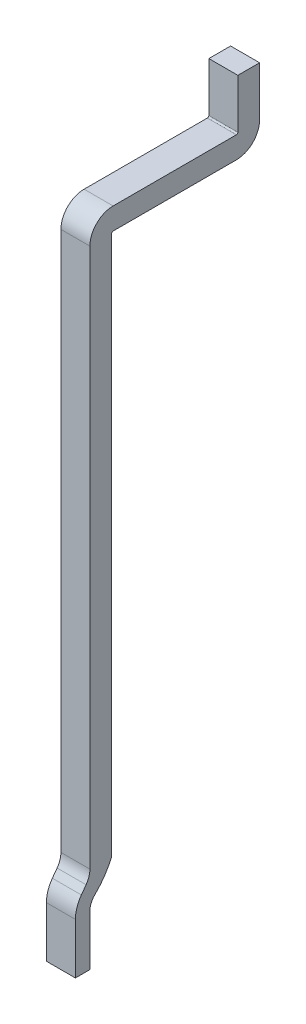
ISO-10303-21;
HEADER;
FILE_DESCRIPTION(('STEP AP214'),'2;1');
FILE_NAME('part.step','',(''),(''),'','','');
FILE_SCHEMA(('AUTOMOTIVE_DESIGN { 1 0 10303 214 1 1 1 1 }'));
ENDSEC;
DATA;
#1=APPLICATION_CONTEXT('core data for automotive mechanical design processes');
#2=APPLICATION_PROTOCOL_DEFINITION('international standard','automotive_design',2000,#1);
#3=PRODUCT_CONTEXT('',#1,'mechanical');
#4=PRODUCT('Part','Part','',(#3));
#5=PRODUCT_RELATED_PRODUCT_CATEGORY('part','',(#4));
#6=PRODUCT_DEFINITION_FORMATION('','',#4);
#7=PRODUCT_DEFINITION_CONTEXT('part definition',#1,'design');
#8=PRODUCT_DEFINITION('design','',#6,#7);
#9=PRODUCT_DEFINITION_SHAPE('','',#8);
#10=(LENGTH_UNIT() NAMED_UNIT(*) SI_UNIT(.MILLI.,.METRE.));
#11=(NAMED_UNIT(*) PLANE_ANGLE_UNIT() SI_UNIT($,.RADIAN.));
#12=(NAMED_UNIT(*) SI_UNIT($,.STERADIAN.) SOLID_ANGLE_UNIT());
#13=UNCERTAINTY_MEASURE_WITH_UNIT(LENGTH_MEASURE(1.E-05),#10,'distance_accuracy_value','');
#14=(GEOMETRIC_REPRESENTATION_CONTEXT(3) GLOBAL_UNCERTAINTY_ASSIGNED_CONTEXT((#13)) GLOBAL_UNIT_ASSIGNED_CONTEXT((#10,
#11,#12)) REPRESENTATION_CONTEXT('',''));
#15=CARTESIAN_POINT('',(0.,0.,0.));
#16=DIRECTION('',(0.,0.,1.));
#17=DIRECTION('',(1.,0.,0.));
#18=AXIS2_PLACEMENT_3D('',#15,#16,#17);
#19=CARTESIAN_POINT('',(-4.898179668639,-0.6,0.15));
#20=DIRECTION('',(0.,0.,1.));
#21=DIRECTION('',(1.,0.,0.));
#22=AXIS2_PLACEMENT_3D('',#19,#20,#21);
#23=PLANE('',#22);
#24=DIRECTION('',(1.,0.,0.));
#25=VECTOR('',#24,1.);
#26=CARTESIAN_POINT('',(-4.898179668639,-0.25,0.15));
#27=LINE('',#26,#25);
#28=CARTESIAN_POINT('',(-0.1,-0.25,0.15));
#29=VERTEX_POINT('',#28);
#30=CARTESIAN_POINT('',(0.1,-0.25,0.15));
#31=VERTEX_POINT('',#30);
#32=EDGE_CURVE('E11',#29,#31,#27,.T.);
#33=ORIENTED_EDGE('',*,*,#32,.T.);
#34=DIRECTION('',(0.,-1.,0.));
#35=VECTOR('',#34,1.);
#36=CARTESIAN_POINT('',(0.1,-0.6,0.15));
#37=LINE('',#36,#35);
#38=CARTESIAN_POINT('',(0.1,-0.6,0.15));
#39=VERTEX_POINT('',#38);
#40=EDGE_CURVE('E242',#31,#39,#37,.T.);
#41=ORIENTED_EDGE('',*,*,#40,.T.);
#42=DIRECTION('',(1.,0.,0.));
#43=VECTOR('',#42,1.);
#44=CARTESIAN_POINT('',(-4.898179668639,-0.6,0.15));
#45=LINE('',#44,#43);
#46=CARTESIAN_POINT('',(-0.1,-0.6,0.15));
#47=VERTEX_POINT('',#46);
#48=EDGE_CURVE('E37',#47,#39,#45,.T.);
#49=ORIENTED_EDGE('',*,*,#48,.F.);
#50=DIRECTION('',(0.,-1.,0.));
#51=VECTOR('',#50,1.);
#52=CARTESIAN_POINT('',(-0.1,3.88,0.15));
#53=LINE('',#52,#51);
#54=EDGE_CURVE('E374',#29,#47,#53,.T.);
#55=ORIENTED_EDGE('',*,*,#54,.F.);
#56=EDGE_LOOP('',(#33,#41,#49,#55));
#57=FACE_BOUND('',#56,.T.);
#58=ADVANCED_FACE('F17',(#57),#23,.F.);
#59=CARTESIAN_POINT('',(-4.898179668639,-0.25,0.03819360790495));
#60=DIRECTION('',(1.,0.,0.));
#61=DIRECTION('',(0.,1.,0.));
#62=AXIS2_PLACEMENT_3D('',#59,#60,#61);
#63=CYLINDRICAL_SURFACE('',#62,0.111806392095);
#64=DIRECTION('',(1.,0.,0.));
#65=VECTOR('',#64,1.);
#66=CARTESIAN_POINT('',(-4.898179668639,-0.169431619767,0.11571396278));
#67=LINE('',#66,#65);
#68=CARTESIAN_POINT('',(-0.1,-0.169431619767,0.11571396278));
#69=VERTEX_POINT('',#68);
#70=CARTESIAN_POINT('',(0.1,-0.169431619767,0.11571396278));
#71=VERTEX_POINT('',#70);
#72=EDGE_CURVE('E25',#69,#71,#67,.T.);
#73=ORIENTED_EDGE('',*,*,#72,.T.);
#74=CARTESIAN_POINT('',(0.1,-0.25,0.03819360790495));
#75=DIRECTION('',(1.,0.,0.));
#76=DIRECTION('',(0.,1.,0.));
#77=AXIS2_PLACEMENT_3D('',#74,#75,#76);
#78=CIRCLE('',#77,0.111806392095);
#79=EDGE_CURVE('E262',#71,#31,#78,.T.);
#80=ORIENTED_EDGE('',*,*,#79,.T.);
#81=ORIENTED_EDGE('',*,*,#32,.F.);
#82=CARTESIAN_POINT('',(-0.1,-0.25,0.03819360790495));
#83=DIRECTION('',(1.,0.,0.));
#84=DIRECTION('',(0.,1.,0.));
#85=AXIS2_PLACEMENT_3D('',#82,#83,#84);
#86=CIRCLE('',#85,0.111806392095);
#87=EDGE_CURVE('E360',#69,#29,#86,.T.);
#88=ORIENTED_EDGE('',*,*,#87,.F.);
#89=EDGE_LOOP('',(#73,#80,#81,#88));
#90=FACE_BOUND('',#89,.T.);
#91=ADVANCED_FACE('F357',(#90),#63,.F.);
#92=CARTESIAN_POINT('',(-4.898179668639,0.192876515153,0.464315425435));
#93=DIRECTION('',(1.,0.,0.));
#94=DIRECTION('',(0.,1.,0.));
#95=AXIS2_PLACEMENT_3D('',#92,#93,#94);
#96=CYLINDRICAL_SURFACE('',#95,0.50278242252);
#97=DIRECTION('',(1.,0.,0.));
#98=VECTOR('',#97,1.);
#99=CARTESIAN_POINT('',(-0.1,0.,0.));
#100=LINE('',#99,#98);
#101=CARTESIAN_POINT('',(-0.1,0.,0.));
#102=VERTEX_POINT('',#101);
#103=CARTESIAN_POINT('',(0.1,0.,0.));
#104=VERTEX_POINT('',#103);
#105=EDGE_CURVE('E258',#102,#104,#100,.T.);
#106=ORIENTED_EDGE('',*,*,#105,.T.);
#107=CARTESIAN_POINT('',(0.1,0.192876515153,0.464315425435));
#108=DIRECTION('',(-1.,0.,0.));
#109=DIRECTION('',(0.,1.,0.));
#110=AXIS2_PLACEMENT_3D('',#107,#108,#109);
#111=CIRCLE('',#110,0.50278242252);
#112=EDGE_CURVE('E266',#104,#71,#111,.T.);
#113=ORIENTED_EDGE('',*,*,#112,.T.);
#114=ORIENTED_EDGE('',*,*,#72,.F.);
#115=CARTESIAN_POINT('',(-0.1,0.192876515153,0.464315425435));
#116=DIRECTION('',(1.,0.,0.));
#117=DIRECTION('',(0.,1.,0.));
#118=AXIS2_PLACEMENT_3D('',#115,#116,#117);
#119=CIRCLE('',#118,0.50278242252);
#120=EDGE_CURVE('E379',#69,#102,#119,.T.);
#121=ORIENTED_EDGE('',*,*,#120,.T.);
#122=EDGE_LOOP('',(#106,#113,#114,#121));
#123=FACE_BOUND('',#122,.T.);
#124=ADVANCED_FACE('F365',(#123),#96,.T.);
#125=CARTESIAN_POINT('',(0.1,-0.25,0.25));
#126=DIRECTION('',(0.,0.,-1.));
#127=DIRECTION('',(0.,-1.,0.));
#128=AXIS2_PLACEMENT_3D('',#125,#126,#127);
#129=PLANE('',#128);
#130=DIRECTION('',(0.,-1.,0.));
#131=VECTOR('',#130,1.);
#132=CARTESIAN_POINT('',(-0.1,-0.25,0.25));
#133=LINE('',#132,#131);
#134=CARTESIAN_POINT('',(-0.1,-0.25,0.25));
#135=VERTEX_POINT('',#134);
#136=CARTESIAN_POINT('',(-0.1,-0.6,0.25));
#137=VERTEX_POINT('',#136);
#138=EDGE_CURVE('E399',#135,#137,#133,.T.);
#139=ORIENTED_EDGE('',*,*,#138,.T.);
#140=DIRECTION('',(-1.,0.,0.));
#141=VECTOR('',#140,1.);
#142=CARTESIAN_POINT('',(0.1,-0.6,0.25));
#143=LINE('',#142,#141);
#144=CARTESIAN_POINT('',(0.1,-0.6,0.25));
#145=VERTEX_POINT('',#144);
#146=EDGE_CURVE('E47',#145,#137,#143,.T.);
#147=ORIENTED_EDGE('',*,*,#146,.F.);
#148=DIRECTION('',(0.,-1.,0.));
#149=VECTOR('',#148,1.);
#150=CARTESIAN_POINT('',(0.1,-0.25,0.25));
#151=LINE('',#150,#149);
#152=CARTESIAN_POINT('',(0.1,-0.25,0.25));
#153=VERTEX_POINT('',#152);
#154=EDGE_CURVE('E322',#153,#145,#151,.T.);
#155=ORIENTED_EDGE('',*,*,#154,.F.);
#156=DIRECTION('',(-1.,0.,0.));
#157=VECTOR('',#156,1.);
#158=CARTESIAN_POINT('',(0.1,-0.25,0.25));
#159=LINE('',#158,#157);
#160=EDGE_CURVE('E350',#153,#135,#159,.T.);
#161=ORIENTED_EDGE('',*,*,#160,.T.);
#162=EDGE_LOOP('',(#139,#147,#155,#161));
#163=FACE_BOUND('',#162,.T.);
#164=ADVANCED_FACE('F744',(#163),#129,.F.);
#165=CARTESIAN_POINT('',(0.1,-0.25,0.03819360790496));
#166=DIRECTION('',(-1.,0.,0.));
#167=DIRECTION('',(0.,0.,1.));
#168=AXIS2_PLACEMENT_3D('',#165,#166,#167);
#169=CYLINDRICAL_SURFACE('',#168,0.211806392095);
#170=CARTESIAN_POINT('',(-0.1,-0.25,0.03819360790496));
#171=DIRECTION('',(1.,0.,0.));
#172=DIRECTION('',(0.,1.,0.));
#173=AXIS2_PLACEMENT_3D('',#170,#171,#172);
#174=CIRCLE('',#173,0.211806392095);
#175=CARTESIAN_POINT('',(-0.1,-0.124683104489,0.208949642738));
#176=VERTEX_POINT('',#175);
#177=EDGE_CURVE('E394',#176,#135,#174,.T.);
#178=ORIENTED_EDGE('',*,*,#177,.T.);
#179=ORIENTED_EDGE('',*,*,#160,.F.);
#180=CARTESIAN_POINT('',(0.1,-0.25,0.03819360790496));
#181=DIRECTION('',(1.,0.,0.));
#182=DIRECTION('',(0.,1.,0.));
#183=AXIS2_PLACEMENT_3D('',#180,#181,#182);
#184=CIRCLE('',#183,0.211806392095);
#185=CARTESIAN_POINT('',(0.1,-0.124683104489,0.208949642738));
#186=VERTEX_POINT('',#185);
#187=EDGE_CURVE('E318',#186,#153,#184,.T.);
#188=ORIENTED_EDGE('',*,*,#187,.F.);
#189=DIRECTION('',(-1.,0.,0.));
#190=VECTOR('',#189,1.);
#191=CARTESIAN_POINT('',(0.1,-0.124683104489,0.208949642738));
#192=LINE('',#191,#190);
#193=EDGE_CURVE('E314',#186,#176,#192,.T.);
#194=ORIENTED_EDGE('',*,*,#193,.T.);
#195=EDGE_LOOP('',(#178,#179,#188,#194));
#196=FACE_BOUND('',#195,.T.);
#197=ADVANCED_FACE('F649',(#196),#169,.T.);
#198=CARTESIAN_POINT('',(0.1,-0.0801201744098,0.176245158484));
#199=DIRECTION('',(0.,-0.591657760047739,-0.806189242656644));
#200=DIRECTION('',(0.,-0.806189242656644,0.591657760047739));
#201=AXIS2_PLACEMENT_3D('',#198,#199,#200);
#202=PLANE('',#201);
#203=DIRECTION('',(0.,-0.806189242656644,0.591657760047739));
#204=VECTOR('',#203,1.);
#205=CARTESIAN_POINT('',(-0.1,-0.0801201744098,0.176245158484));
#206=LINE('',#205,#204);
#207=CARTESIAN_POINT('',(-0.1,-0.0801201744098,0.176245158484));
#208=VERTEX_POINT('',#207);
#209=EDGE_CURVE('E398',#208,#176,#206,.T.);
#210=ORIENTED_EDGE('',*,*,#209,.T.);
#211=ORIENTED_EDGE('',*,*,#193,.F.);
#212=DIRECTION('',(0.,-0.806189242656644,0.591657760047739));
#213=VECTOR('',#212,1.);
#214=CARTESIAN_POINT('',(0.1,-0.0801201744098,0.176245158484));
#215=LINE('',#214,#213);
#216=CARTESIAN_POINT('',(0.1,-0.0801201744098,0.176245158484));
#217=VERTEX_POINT('',#216);
#218=EDGE_CURVE('E310',#217,#186,#215,.T.);
#219=ORIENTED_EDGE('',*,*,#218,.F.);
#220=DIRECTION('',(-1.,0.,0.));
#221=VECTOR('',#220,1.);
#222=CARTESIAN_POINT('',(0.1,-0.0801201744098,0.176245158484));
#223=LINE('',#222,#221);
#224=EDGE_CURVE('E311',#217,#208,#223,.T.);
#225=ORIENTED_EDGE('',*,*,#224,.T.);
#226=EDGE_LOOP('',(#210,#211,#219,#225));
#227=FACE_BOUND('',#226,.T.);
#228=ADVANCED_FACE('F644',(#227),#202,.F.);
#229=CARTESIAN_POINT('',(0.1,0.,0.285416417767));
#230=DIRECTION('',(-1.,0.,0.));
#231=DIRECTION('',(0.,0.,1.));
#232=AXIS2_PLACEMENT_3D('',#229,#230,#231);
#233=CYLINDRICAL_SURFACE('',#232,0.135416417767);
#234=CARTESIAN_POINT('',(-0.1,0.,0.285416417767));
#235=DIRECTION('',(-1.,0.,0.));
#236=DIRECTION('',(0.,1.,0.));
#237=AXIS2_PLACEMENT_3D('',#234,#235,#236);
#238=CIRCLE('',#237,0.135416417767);
#239=CARTESIAN_POINT('',(-0.1,0.,0.15));
#240=VERTEX_POINT('',#239);
#241=EDGE_CURVE('E411',#240,#208,#238,.T.);
#242=ORIENTED_EDGE('',*,*,#241,.T.);
#243=ORIENTED_EDGE('',*,*,#224,.F.);
#244=CARTESIAN_POINT('',(0.1,0.,0.285416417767));
#245=DIRECTION('',(-1.,0.,0.));
#246=DIRECTION('',(0.,1.,0.));
#247=AXIS2_PLACEMENT_3D('',#244,#245,#246);
#248=CIRCLE('',#247,0.135416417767);
#249=CARTESIAN_POINT('',(0.1,0.,0.15));
#250=VERTEX_POINT('',#249);
#251=EDGE_CURVE('E303',#250,#217,#248,.T.);
#252=ORIENTED_EDGE('',*,*,#251,.F.);
#253=DIRECTION('',(1.,0.,0.));
#254=VECTOR('',#253,1.);
#255=CARTESIAN_POINT('',(-0.1,0.,0.15));
#256=LINE('',#255,#254);
#257=EDGE_CURVE('E241',#240,#250,#256,.T.);
#258=ORIENTED_EDGE('',*,*,#257,.F.);
#259=EDGE_LOOP('',(#242,#243,#252,#258));
#260=FACE_BOUND('',#259,.T.);
#261=ADVANCED_FACE('F638',(#260),#233,.F.);
#262=CARTESIAN_POINT('',(0.1,-0.6,0.25));
#263=DIRECTION('',(0.,-1.,0.));
#264=DIRECTION('',(-1.,0.,0.));
#265=AXIS2_PLACEMENT_3D('',#262,#263,#264);
#266=PLANE('',#265);
#267=ORIENTED_EDGE('',*,*,#48,.T.);
#268=DIRECTION('',(0.,0.,1.));
#269=VECTOR('',#268,1.);
#270=CARTESIAN_POINT('',(0.1,-0.6,0.25));
#271=LINE('',#270,#269);
#272=EDGE_CURVE('E326',#39,#145,#271,.T.);
#273=ORIENTED_EDGE('',*,*,#272,.T.);
#274=ORIENTED_EDGE('',*,*,#146,.T.);
#275=DIRECTION('',(0.,0.,1.));
#276=VECTOR('',#275,1.);
#277=CARTESIAN_POINT('',(-0.1,-0.6,0.25));
#278=LINE('',#277,#276);
#279=EDGE_CURVE('E377',#47,#137,#278,.T.);
#280=ORIENTED_EDGE('',*,*,#279,.F.);
#281=EDGE_LOOP('',(#267,#273,#274,#280));
#282=FACE_BOUND('',#281,.T.);
#283=ADVANCED_FACE('F633',(#282),#266,.T.);
#284=CARTESIAN_POINT('',(0.1,3.89,-0.86));
#285=DIRECTION('',(-1.,0.,0.));
#286=DIRECTION('',(0.,1.,0.));
#287=AXIS2_PLACEMENT_3D('',#284,#285,#286);
#288=CYLINDRICAL_SURFACE('',#287,0.01);
#289=CARTESIAN_POINT('',(-0.1,3.89,-0.86));
#290=DIRECTION('',(-1.,0.,0.));
#291=DIRECTION('',(0.,-1.,0.));
#292=AXIS2_PLACEMENT_3D('',#289,#290,#291);
#293=CIRCLE('',#292,0.01);
#294=CARTESIAN_POINT('',(-0.1,3.89,-0.87));
#295=VERTEX_POINT('',#294);
#296=CARTESIAN_POINT('',(-0.1,3.88,-0.86));
#297=VERTEX_POINT('',#296);
#298=EDGE_CURVE('E208',#295,#297,#293,.T.);
#299=ORIENTED_EDGE('',*,*,#298,.T.);
#300=DIRECTION('',(-1.,0.,0.));
#301=VECTOR('',#300,1.);
#302=CARTESIAN_POINT('',(0.1,3.88,-0.86));
#303=LINE('',#302,#301);
#304=CARTESIAN_POINT('',(0.1,3.88,-0.86));
#305=VERTEX_POINT('',#304);
#306=EDGE_CURVE('E192',#305,#297,#303,.T.);
#307=ORIENTED_EDGE('',*,*,#306,.F.);
#308=CARTESIAN_POINT('',(0.1,3.89,-0.86));
#309=DIRECTION('',(-1.,0.,0.));
#310=DIRECTION('',(0.,-1.,0.));
#311=AXIS2_PLACEMENT_3D('',#308,#309,#310);
#312=CIRCLE('',#311,0.01);
#313=CARTESIAN_POINT('',(0.1,3.89,-0.87));
#314=VERTEX_POINT('',#313);
#315=EDGE_CURVE('E247',#314,#305,#312,.T.);
#316=ORIENTED_EDGE('',*,*,#315,.F.);
#317=DIRECTION('',(-1.,0.,0.));
#318=VECTOR('',#317,1.);
#319=CARTESIAN_POINT('',(0.1,3.89,-0.87));
#320=LINE('',#319,#318);
#321=EDGE_CURVE('E210',#314,#295,#320,.T.);
#322=ORIENTED_EDGE('',*,*,#321,.T.);
#323=EDGE_LOOP('',(#299,#307,#316,#322));
#324=FACE_BOUND('',#323,.T.);
#325=ADVANCED_FACE('F209',(#324),#288,.F.);
#326=CARTESIAN_POINT('',(0.1,3.89,-0.86));
#327=DIRECTION('',(-1.,0.,0.));
#328=DIRECTION('',(0.,1.,0.));
#329=AXIS2_PLACEMENT_3D('',#326,#327,#328);
#330=CYLINDRICAL_SURFACE('',#329,0.16);
#331=CARTESIAN_POINT('',(-0.1,3.89,-0.86));
#332=DIRECTION('',(-1.,0.,0.));
#333=DIRECTION('',(0.,1.,0.));
#334=AXIS2_PLACEMENT_3D('',#331,#332,#333);
#335=CIRCLE('',#334,0.16);
#336=CARTESIAN_POINT('',(-0.1,3.89,-1.02));
#337=VERTEX_POINT('',#336);
#338=CARTESIAN_POINT('',(-0.1,3.73,-0.86));
#339=VERTEX_POINT('',#338);
#340=EDGE_CURVE('E254',#337,#339,#335,.T.);
#341=ORIENTED_EDGE('',*,*,#340,.F.);
#342=DIRECTION('',(-1.,0.,0.));
#343=VECTOR('',#342,1.);
#344=CARTESIAN_POINT('',(0.1,3.89,-1.02));
#345=LINE('',#344,#343);
#346=CARTESIAN_POINT('',(0.1,3.89,-1.02));
#347=VERTEX_POINT('',#346);
#348=EDGE_CURVE('E236',#347,#337,#345,.T.);
#349=ORIENTED_EDGE('',*,*,#348,.F.);
#350=CARTESIAN_POINT('',(0.1,3.89,-0.86));
#351=DIRECTION('',(1.,0.,0.));
#352=DIRECTION('',(0.,1.,0.));
#353=AXIS2_PLACEMENT_3D('',#350,#351,#352);
#354=CIRCLE('',#353,0.16);
#355=CARTESIAN_POINT('',(0.1,3.73,-0.86));
#356=VERTEX_POINT('',#355);
#357=EDGE_CURVE('E282',#356,#347,#354,.T.);
#358=ORIENTED_EDGE('',*,*,#357,.F.);
#359=DIRECTION('',(-1.,0.,0.));
#360=VECTOR('',#359,1.);
#361=CARTESIAN_POINT('',(0.1,3.73,-0.86));
#362=LINE('',#361,#360);
#363=EDGE_CURVE('E234',#356,#339,#362,.T.);
#364=ORIENTED_EDGE('',*,*,#363,.T.);
#365=EDGE_LOOP('',(#341,#349,#358,#364));
#366=FACE_BOUND('',#365,.T.);
#367=ADVANCED_FACE('F439',(#366),#330,.T.);
#368=CARTESIAN_POINT('',(-0.1,4.23,-1.02));
#369=DIRECTION('',(0.,-1.,0.));
#370=DIRECTION('',(0.,0.,-1.));
#371=AXIS2_PLACEMENT_3D('',#368,#369,#370);
#372=PLANE('',#371);
#373=DIRECTION('',(1.,0.,0.));
#374=VECTOR('',#373,1.);
#375=CARTESIAN_POINT('',(-0.1,4.23,-0.87));
#376=LINE('',#375,#374);
#377=CARTESIAN_POINT('',(-0.1,4.23,-0.87));
#378=VERTEX_POINT('',#377);
#379=CARTESIAN_POINT('',(0.1,4.23,-0.87));
#380=VERTEX_POINT('',#379);
#381=EDGE_CURVE('E304',#378,#380,#376,.T.);
#382=ORIENTED_EDGE('',*,*,#381,.T.);
#383=DIRECTION('',(0.,0.,1.));
#384=VECTOR('',#383,1.);
#385=CARTESIAN_POINT('',(0.1,4.23,-1.02));
#386=LINE('',#385,#384);
#387=CARTESIAN_POINT('',(0.1,4.23,-1.02));
#388=VERTEX_POINT('',#387);
#389=EDGE_CURVE('E248',#388,#380,#386,.T.);
#390=ORIENTED_EDGE('',*,*,#389,.F.);
#391=DIRECTION('',(1.,0.,0.));
#392=VECTOR('',#391,1.);
#393=CARTESIAN_POINT('',(-0.1,4.23,-1.02));
#394=LINE('',#393,#392);
#395=CARTESIAN_POINT('',(-0.1,4.23,-1.02));
#396=VERTEX_POINT('',#395);
#397=EDGE_CURVE('E341',#396,#388,#394,.T.);
#398=ORIENTED_EDGE('',*,*,#397,.F.);
#399=DIRECTION('',(0.,0.,1.));
#400=VECTOR('',#399,1.);
#401=CARTESIAN_POINT('',(-0.1,4.23,-1.02));
#402=LINE('',#401,#400);
#403=EDGE_CURVE('E391',#396,#378,#402,.T.);
#404=ORIENTED_EDGE('',*,*,#403,.T.);
#405=EDGE_LOOP('',(#382,#390,#398,#404));
#406=FACE_BOUND('',#405,.T.);
#407=ADVANCED_FACE('F433',(#406),#372,.F.);
#408=CARTESIAN_POINT('',(0.,0.,-0.87));
#409=DIRECTION('',(0.,0.,-1.));
#410=DIRECTION('',(0.,-1.,0.));
#411=AXIS2_PLACEMENT_3D('',#408,#409,#410);
#412=PLANE('',#411);
#413=ORIENTED_EDGE('',*,*,#321,.F.);
#414=DIRECTION('',(0.,-1.,0.));
#415=VECTOR('',#414,1.);
#416=CARTESIAN_POINT('',(0.1,3.843268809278,-0.87));
#417=LINE('',#416,#415);
#418=EDGE_CURVE('E243',#380,#314,#417,.T.);
#419=ORIENTED_EDGE('',*,*,#418,.F.);
#420=ORIENTED_EDGE('',*,*,#381,.F.);
#421=DIRECTION('',(0.,1.,0.));
#422=VECTOR('',#421,1.);
#423=CARTESIAN_POINT('',(-0.1,3.843268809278,-0.87));
#424=LINE('',#423,#422);
#425=EDGE_CURVE('E215',#295,#378,#424,.T.);
#426=ORIENTED_EDGE('',*,*,#425,.F.);
#427=EDGE_LOOP('',(#413,#419,#420,#426));
#428=FACE_BOUND('',#427,.T.);
#429=ADVANCED_FACE('F702',(#428),#412,.F.);
#430=CARTESIAN_POINT('',(0.,0.,-1.02));
#431=DIRECTION('',(0.,0.,-1.));
#432=DIRECTION('',(0.,-1.,0.));
#433=AXIS2_PLACEMENT_3D('',#430,#431,#432);
#434=PLANE('',#433);
#435=DIRECTION('',(0.,-1.,0.));
#436=VECTOR('',#435,1.);
#437=CARTESIAN_POINT('',(0.1,3.843268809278,-1.02));
#438=LINE('',#437,#436);
#439=EDGE_CURVE('E286',#388,#347,#438,.T.);
#440=ORIENTED_EDGE('',*,*,#439,.T.);
#441=ORIENTED_EDGE('',*,*,#348,.T.);
#442=DIRECTION('',(0.,1.,0.));
#443=VECTOR('',#442,1.);
#444=CARTESIAN_POINT('',(-0.1,3.843268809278,-1.02));
#445=LINE('',#444,#443);
#446=EDGE_CURVE('E232',#337,#396,#445,.T.);
#447=ORIENTED_EDGE('',*,*,#446,.T.);
#448=ORIENTED_EDGE('',*,*,#397,.T.);
#449=EDGE_LOOP('',(#440,#441,#447,#448));
#450=FACE_BOUND('',#449,.T.);
#451=ADVANCED_FACE('F430',(#450),#434,.T.);
#452=CARTESIAN_POINT('',(0.1,3.72,-0.01));
#453=DIRECTION('',(-1.,0.,0.));
#454=DIRECTION('',(0.,0.,-1.));
#455=AXIS2_PLACEMENT_3D('',#452,#453,#454);
#456=CYLINDRICAL_SURFACE('',#455,0.01);
#457=DIRECTION('',(-1.,0.,0.));
#458=VECTOR('',#457,1.);
#459=CARTESIAN_POINT('',(0.1,3.72,0.));
#460=LINE('',#459,#458);
#461=CARTESIAN_POINT('',(0.1,3.72,0.));
#462=VERTEX_POINT('',#461);
#463=CARTESIAN_POINT('',(-0.1,3.72,0.));
#464=VERTEX_POINT('',#463);
#465=EDGE_CURVE('E255',#462,#464,#460,.T.);
#466=ORIENTED_EDGE('',*,*,#465,.T.);
#467=CARTESIAN_POINT('',(-0.1,3.72,-0.01));
#468=DIRECTION('',(-1.,0.,0.));
#469=DIRECTION('',(0.,0.,1.));
#470=AXIS2_PLACEMENT_3D('',#467,#468,#469);
#471=CIRCLE('',#470,0.01);
#472=CARTESIAN_POINT('',(-0.1,3.73,-0.01));
#473=VERTEX_POINT('',#472);
#474=EDGE_CURVE('E253',#464,#473,#471,.T.);
#475=ORIENTED_EDGE('',*,*,#474,.T.);
#476=DIRECTION('',(1.,0.,0.));
#477=VECTOR('',#476,1.);
#478=CARTESIAN_POINT('',(-0.1,3.73,-0.01));
#479=LINE('',#478,#477);
#480=CARTESIAN_POINT('',(0.1,3.73,-0.01));
#481=VERTEX_POINT('',#480);
#482=EDGE_CURVE('E204',#473,#481,#479,.T.);
#483=ORIENTED_EDGE('',*,*,#482,.T.);
#484=CARTESIAN_POINT('',(0.1,3.72,-0.01));
#485=DIRECTION('',(-1.,0.,0.));
#486=DIRECTION('',(0.,0.,1.));
#487=AXIS2_PLACEMENT_3D('',#484,#485,#486);
#488=CIRCLE('',#487,0.01);
#489=EDGE_CURVE('E274',#462,#481,#488,.T.);
#490=ORIENTED_EDGE('',*,*,#489,.F.);
#491=EDGE_LOOP('',(#466,#475,#483,#490));
#492=FACE_BOUND('',#491,.T.);
#493=ADVANCED_FACE('F660',(#492),#456,.F.);
#494=CARTESIAN_POINT('',(0.1,3.72,-0.01));
#495=DIRECTION('',(-1.,0.,0.));
#496=DIRECTION('',(0.,0.,-1.));
#497=AXIS2_PLACEMENT_3D('',#494,#495,#496);
#498=CYLINDRICAL_SURFACE('',#497,0.16);
#499=DIRECTION('',(-1.,0.,0.));
#500=VECTOR('',#499,1.);
#501=CARTESIAN_POINT('',(0.1,3.72,0.15));
#502=LINE('',#501,#500);
#503=CARTESIAN_POINT('',(0.1,3.72,0.15));
#504=VERTEX_POINT('',#503);
#505=CARTESIAN_POINT('',(-0.1,3.72,0.15));
#506=VERTEX_POINT('',#505);
#507=EDGE_CURVE('E238',#504,#506,#502,.T.);
#508=ORIENTED_EDGE('',*,*,#507,.F.);
#509=CARTESIAN_POINT('',(0.1,3.72,-0.01));
#510=DIRECTION('',(-1.,0.,0.));
#511=DIRECTION('',(0.,0.,-1.));
#512=AXIS2_PLACEMENT_3D('',#509,#510,#511);
#513=CIRCLE('',#512,0.16);
#514=CARTESIAN_POINT('',(0.1,3.88,-0.01));
#515=VERTEX_POINT('',#514);
#516=EDGE_CURVE('E295',#504,#515,#513,.T.);
#517=ORIENTED_EDGE('',*,*,#516,.T.);
#518=DIRECTION('',(1.,0.,0.));
#519=VECTOR('',#518,1.);
#520=CARTESIAN_POINT('',(-0.1,3.88,-0.01));
#521=LINE('',#520,#519);
#522=CARTESIAN_POINT('',(-0.1,3.88,-0.01));
#523=VERTEX_POINT('',#522);
#524=EDGE_CURVE('E205',#523,#515,#521,.T.);
#525=ORIENTED_EDGE('',*,*,#524,.F.);
#526=CARTESIAN_POINT('',(-0.1,3.72,-0.01));
#527=DIRECTION('',(1.,0.,0.));
#528=DIRECTION('',(0.,0.,-1.));
#529=AXIS2_PLACEMENT_3D('',#526,#527,#528);
#530=CIRCLE('',#529,0.16);
#531=EDGE_CURVE('E221',#523,#506,#530,.T.);
#532=ORIENTED_EDGE('',*,*,#531,.T.);
#533=EDGE_LOOP('',(#508,#517,#525,#532));
#534=FACE_BOUND('',#533,.T.);
#535=ADVANCED_FACE('F655',(#534),#498,.T.);
#536=CARTESIAN_POINT('',(0.,3.73,0.));
#537=DIRECTION('',(0.,1.,0.));
#538=DIRECTION('',(0.,0.,-1.));
#539=AXIS2_PLACEMENT_3D('',#536,#537,#538);
#540=PLANE('',#539);
#541=ORIENTED_EDGE('',*,*,#482,.F.);
#542=DIRECTION('',(0.,0.,1.));
#543=VECTOR('',#542,1.);
#544=CARTESIAN_POINT('',(-0.1,3.73,0.03673119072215));
#545=LINE('',#544,#543);
#546=EDGE_CURVE('E249',#339,#473,#545,.T.);
#547=ORIENTED_EDGE('',*,*,#546,.F.);
#548=ORIENTED_EDGE('',*,*,#363,.F.);
#549=DIRECTION('',(0.,0.,-1.));
#550=VECTOR('',#549,1.);
#551=CARTESIAN_POINT('',(0.1,3.73,0.03673119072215));
#552=LINE('',#551,#550);
#553=EDGE_CURVE('E278',#481,#356,#552,.T.);
#554=ORIENTED_EDGE('',*,*,#553,.F.);
#555=EDGE_LOOP('',(#541,#547,#548,#554));
#556=FACE_BOUND('',#555,.T.);
#557=ADVANCED_FACE('F442',(#556),#540,.F.);
#558=CARTESIAN_POINT('',(0.,3.88,0.));
#559=DIRECTION('',(0.,1.,0.));
#560=DIRECTION('',(0.,0.,-1.));
#561=AXIS2_PLACEMENT_3D('',#558,#559,#560);
#562=PLANE('',#561);
#563=DIRECTION('',(0.,0.,1.));
#564=VECTOR('',#563,1.);
#565=CARTESIAN_POINT('',(-0.1,3.88,0.03673119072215));
#566=LINE('',#565,#564);
#567=EDGE_CURVE('E196',#297,#523,#566,.T.);
#568=ORIENTED_EDGE('',*,*,#567,.T.);
#569=ORIENTED_EDGE('',*,*,#524,.T.);
#570=DIRECTION('',(0.,0.,-1.));
#571=VECTOR('',#570,1.);
#572=CARTESIAN_POINT('',(0.1,3.88,0.03673119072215));
#573=LINE('',#572,#571);
#574=EDGE_CURVE('E199',#515,#305,#573,.T.);
#575=ORIENTED_EDGE('',*,*,#574,.T.);
#576=ORIENTED_EDGE('',*,*,#306,.T.);
#577=EDGE_LOOP('',(#568,#569,#575,#576));
#578=FACE_BOUND('',#577,.T.);
#579=ADVANCED_FACE('F194',(#578),#562,.T.);
#580=CARTESIAN_POINT('',(0.,0.,0.));
#581=DIRECTION('',(0.,0.,1.));
#582=DIRECTION('',(1.,0.,0.));
#583=AXIS2_PLACEMENT_3D('',#580,#581,#582);
#584=PLANE('',#583);
#585=ORIENTED_EDGE('',*,*,#465,.F.);
#586=DIRECTION('',(0.,1.,0.));
#587=VECTOR('',#586,1.);
#588=CARTESIAN_POINT('',(0.1,0.,0.));
#589=LINE('',#588,#587);
#590=EDGE_CURVE('E270',#104,#462,#589,.T.);
#591=ORIENTED_EDGE('',*,*,#590,.F.);
#592=ORIENTED_EDGE('',*,*,#105,.F.);
#593=DIRECTION('',(0.,-1.,0.));
#594=VECTOR('',#593,1.);
#595=CARTESIAN_POINT('',(-0.1,3.88,0.));
#596=LINE('',#595,#594);
#597=EDGE_CURVE('E385',#464,#102,#596,.T.);
#598=ORIENTED_EDGE('',*,*,#597,.F.);
#599=EDGE_LOOP('',(#585,#591,#592,#598));
#600=FACE_BOUND('',#599,.T.);
#601=ADVANCED_FACE('F447',(#600),#584,.F.);
#602=CARTESIAN_POINT('',(0.,0.,0.15));
#603=DIRECTION('',(0.,0.,1.));
#604=DIRECTION('',(1.,0.,0.));
#605=AXIS2_PLACEMENT_3D('',#602,#603,#604);
#606=PLANE('',#605);
#607=DIRECTION('',(0.,1.,0.));
#608=VECTOR('',#607,1.);
#609=CARTESIAN_POINT('',(0.1,0.,0.15));
#610=LINE('',#609,#608);
#611=EDGE_CURVE('E299',#250,#504,#610,.T.);
#612=ORIENTED_EDGE('',*,*,#611,.T.);
#613=ORIENTED_EDGE('',*,*,#507,.T.);
#614=DIRECTION('',(0.,-1.,0.));
#615=VECTOR('',#614,1.);
#616=CARTESIAN_POINT('',(-0.1,3.88,0.15));
#617=LINE('',#616,#615);
#618=EDGE_CURVE('E228',#506,#240,#617,.T.);
#619=ORIENTED_EDGE('',*,*,#618,.T.);
#620=ORIENTED_EDGE('',*,*,#257,.T.);
#621=EDGE_LOOP('',(#612,#613,#619,#620));
#622=FACE_BOUND('',#621,.T.);
#623=ADVANCED_FACE('F627',(#622),#606,.T.);
#624=CARTESIAN_POINT('',(0.1,0.,0.15));
#625=DIRECTION('',(-1.,0.,0.));
#626=DIRECTION('',(0.,0.,1.));
#627=AXIS2_PLACEMENT_3D('',#624,#625,#626);
#628=PLANE('',#627);
#629=ORIENTED_EDGE('',*,*,#79,.F.);
#630=ORIENTED_EDGE('',*,*,#112,.F.);
#631=ORIENTED_EDGE('',*,*,#590,.T.);
#632=ORIENTED_EDGE('',*,*,#489,.T.);
#633=ORIENTED_EDGE('',*,*,#553,.T.);
#634=ORIENTED_EDGE('',*,*,#357,.T.);
#635=ORIENTED_EDGE('',*,*,#439,.F.);
#636=ORIENTED_EDGE('',*,*,#389,.T.);
#637=ORIENTED_EDGE('',*,*,#418,.T.);
#638=ORIENTED_EDGE('',*,*,#315,.T.);
#639=ORIENTED_EDGE('',*,*,#574,.F.);
#640=ORIENTED_EDGE('',*,*,#516,.F.);
#641=ORIENTED_EDGE('',*,*,#611,.F.);
#642=ORIENTED_EDGE('',*,*,#251,.T.);
#643=ORIENTED_EDGE('',*,*,#218,.T.);
#644=ORIENTED_EDGE('',*,*,#187,.T.);
#645=ORIENTED_EDGE('',*,*,#154,.T.);
#646=ORIENTED_EDGE('',*,*,#272,.F.);
#647=ORIENTED_EDGE('',*,*,#40,.F.);
#648=EDGE_LOOP('',(#629,#630,#631,#632,#633,#634,#635,#636,#637,#638,#639,#640,#641,#642,#643,
#644,#645,#646,#647));
#649=FACE_BOUND('',#648,.T.);
#650=ADVANCED_FACE('F369',(#649),#628,.F.);
#651=CARTESIAN_POINT('',(-0.1,3.88,0.15));
#652=DIRECTION('',(1.,0.,0.));
#653=DIRECTION('',(0.,1.,0.));
#654=AXIS2_PLACEMENT_3D('',#651,#652,#653);
#655=PLANE('',#654);
#656=ORIENTED_EDGE('',*,*,#597,.T.);
#657=ORIENTED_EDGE('',*,*,#120,.F.);
#658=ORIENTED_EDGE('',*,*,#87,.T.);
#659=ORIENTED_EDGE('',*,*,#54,.T.);
#660=ORIENTED_EDGE('',*,*,#279,.T.);
#661=ORIENTED_EDGE('',*,*,#138,.F.);
#662=ORIENTED_EDGE('',*,*,#177,.F.);
#663=ORIENTED_EDGE('',*,*,#209,.F.);
#664=ORIENTED_EDGE('',*,*,#241,.F.);
#665=ORIENTED_EDGE('',*,*,#618,.F.);
#666=ORIENTED_EDGE('',*,*,#531,.F.);
#667=ORIENTED_EDGE('',*,*,#567,.F.);
#668=ORIENTED_EDGE('',*,*,#298,.F.);
#669=ORIENTED_EDGE('',*,*,#425,.T.);
#670=ORIENTED_EDGE('',*,*,#403,.F.);
#671=ORIENTED_EDGE('',*,*,#446,.F.);
#672=ORIENTED_EDGE('',*,*,#340,.T.);
#673=ORIENTED_EDGE('',*,*,#546,.T.);
#674=ORIENTED_EDGE('',*,*,#474,.F.);
#675=EDGE_LOOP('',(#656,#657,#658,#659,#660,#661,#662,#663,#664,#665,#666,#667,#668,#669,#670,
#671,#672,#673,#674));
#676=FACE_BOUND('',#675,.T.);
#677=ADVANCED_FACE('F218',(#676),#655,.F.);
#678=CLOSED_SHELL('',(#58,#91,#124,#164,#197,#228,#261,#283,#325,#367,#407,#429,#451,#493,#535,
#557,#579,#601,#623,#650,#677));
#679=MANIFOLD_SOLID_BREP('B1',#678);
#680=ADVANCED_BREP_SHAPE_REPRESENTATION('',(#18,#679),#14);
#681=SHAPE_DEFINITION_REPRESENTATION(#9,#680);
ENDSEC;
END-ISO-10303-21;
